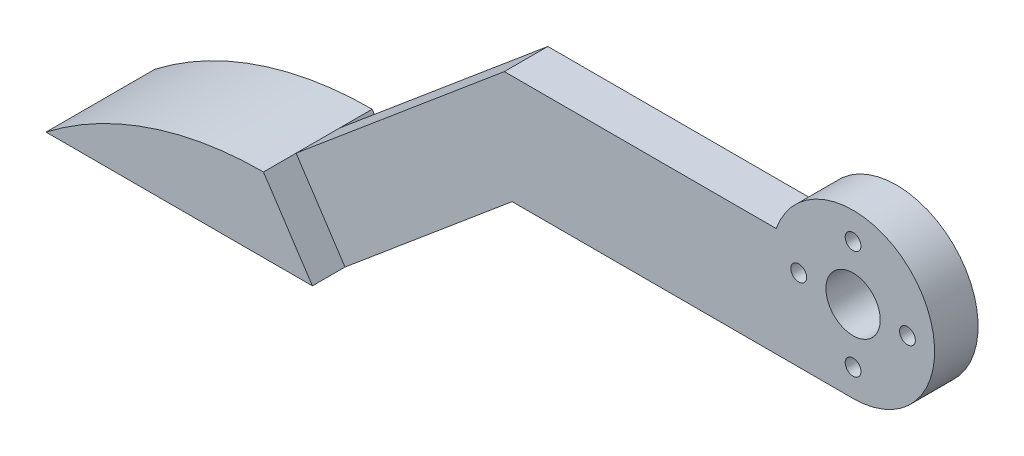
from build123d import *

# Parameters (mm, degrees)
SKETCH1_R           = 5
BOSS_EXTRUDE1_DEPTH = 8
SKETCH3_R           = 1.45
CUT_EXTRUDE1_DEPTH  = 111.555958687
BOSS_EXTRUDE2_DEPTH = 10


with BuildPart() as part:
    # Sketch1 → Boss-Extrude1 (new body)
    with BuildSketch(Plane.XY):
        with BuildLine():
            Line((-14.142135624, 5), (-64.142135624, 5))
            Line((-64.142135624, 5), (-102.44435778, -27.139380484))
            Line((-102.44435778, -27.139380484), (-93.44435778, -40.789380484))
            Line((-93.44435778, -40.789380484), (-62.709770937, -15))
            Line((-62.709770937, -15), (0, -15))
            ThreePointArc((0, -15), (12.247448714, 8.660254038), (-14.142135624, 5))
        make_face()
        Circle(SKETCH1_R, mode=Mode.SUBTRACT)
    extrude(amount=BOSS_EXTRUDE1_DEPTH)

    # Sketch3 → Cut-Extrude1 (cut, through all)
    with BuildSketch(Plane(origin=(0, 0, 0), x_dir=(-1, 0, 0), z_dir=(0, 0, -1))):
        with Locations((-10, 0)):
            Circle(SKETCH3_R)
        with Locations((10, 0)):
            Circle(SKETCH3_R)
        with Locations((0, -10)):
            Circle(SKETCH3_R)
        with Locations((0, 10)):
            Circle(SKETCH3_R)
    extrude(amount=-CUT_EXTRUDE1_DEPTH, mode=Mode.SUBTRACT)

    # Sketch6 → Boss-Extrude2 (add, symmetric)
    with BuildSketch(Plane.XY.offset(4)):
        with BuildLine():
            Line((-142.44435778, -40.789380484), (-93.44435778, -40.789380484))
            Line((-93.44435778, -40.789380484), (-102.44435778, -27.139380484))
            ThreePointArc((-102.44435778, -27.139380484), (-123.576812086, -30.645833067), (-142.44435778, -40.789380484))
        make_face()
    extrude(amount=BOSS_EXTRUDE2_DEPTH, both=True)


solid = part.part
